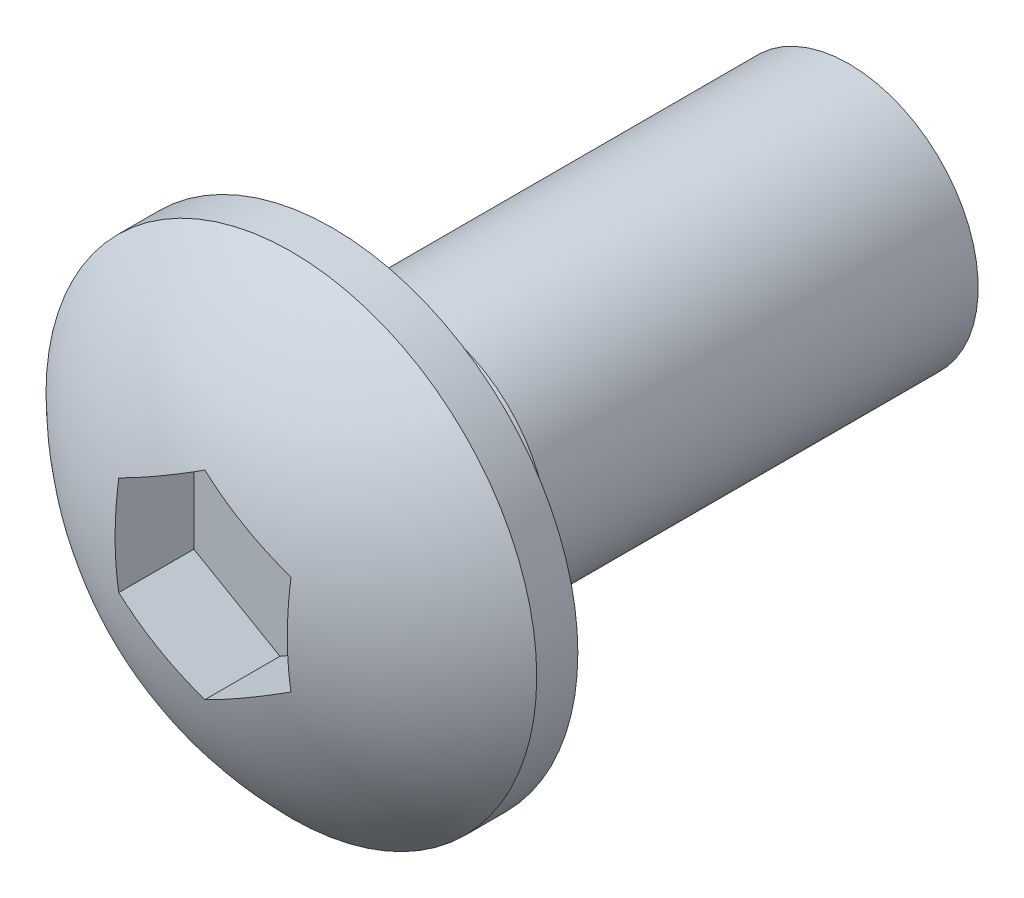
ISO-10303-21;
HEADER;
FILE_DESCRIPTION(('STEP AP214'),'2;1');
FILE_NAME('part.step','',(''),(''),'','','');
FILE_SCHEMA(('AUTOMOTIVE_DESIGN { 1 0 10303 214 1 1 1 1 }'));
ENDSEC;
DATA;
#1=APPLICATION_CONTEXT('core data for automotive mechanical design processes');
#2=APPLICATION_PROTOCOL_DEFINITION('international standard','automotive_design',2000,#1);
#3=PRODUCT_CONTEXT('',#1,'mechanical');
#4=PRODUCT('Part','Part','',(#3));
#5=PRODUCT_RELATED_PRODUCT_CATEGORY('part','',(#4));
#6=PRODUCT_DEFINITION_FORMATION('','',#4);
#7=PRODUCT_DEFINITION_CONTEXT('part definition',#1,'design');
#8=PRODUCT_DEFINITION('design','',#6,#7);
#9=PRODUCT_DEFINITION_SHAPE('','',#8);
#10=(LENGTH_UNIT() NAMED_UNIT(*) SI_UNIT(.MILLI.,.METRE.));
#11=(NAMED_UNIT(*) PLANE_ANGLE_UNIT() SI_UNIT($,.RADIAN.));
#12=(NAMED_UNIT(*) SI_UNIT($,.STERADIAN.) SOLID_ANGLE_UNIT());
#13=UNCERTAINTY_MEASURE_WITH_UNIT(LENGTH_MEASURE(1.E-05),#10,'distance_accuracy_value','');
#14=(GEOMETRIC_REPRESENTATION_CONTEXT(3) GLOBAL_UNCERTAINTY_ASSIGNED_CONTEXT((#13)) GLOBAL_UNIT_ASSIGNED_CONTEXT((#10,
#11,#12)) REPRESENTATION_CONTEXT('',''));
#15=CARTESIAN_POINT('',(0.,0.,0.));
#16=DIRECTION('',(0.,0.,1.));
#17=DIRECTION('',(1.,0.,0.));
#18=AXIS2_PLACEMENT_3D('',#15,#16,#17);
#19=CARTESIAN_POINT('',(0.,2.85,0.));
#20=DIRECTION('',(0.,0.,-1.));
#21=DIRECTION('',(0.,1.,0.));
#22=AXIS2_PLACEMENT_3D('',#19,#20,#21);
#23=PLANE('',#22);
#24=CARTESIAN_POINT('',(0.,0.,0.));
#25=DIRECTION('',(0.,0.,-1.));
#26=DIRECTION('',(0.,1.,0.));
#27=AXIS2_PLACEMENT_3D('',#24,#25,#26);
#28=CIRCLE('',#27,1.45771027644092);
#29=CARTESIAN_POINT('',(0.,1.45771027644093,0.));
#30=VERTEX_POINT('',#29);
#31=EDGE_CURVE('E132',#30,#30,#28,.F.);
#32=ORIENTED_EDGE('',*,*,#31,.T.);
#33=EDGE_LOOP('',(#32));
#34=FACE_BOUND('',#33,.T.);
#35=CARTESIAN_POINT('',(0.,0.,0.));
#36=DIRECTION('',(0.,0.,1.));
#37=DIRECTION('',(0.,-1.,0.));
#38=AXIS2_PLACEMENT_3D('',#35,#36,#37);
#39=CIRCLE('',#38,2.84999999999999);
#40=CARTESIAN_POINT('',(0.,-2.84999999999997,0.));
#41=VERTEX_POINT('',#40);
#42=EDGE_CURVE('E129',#41,#41,#39,.T.);
#43=ORIENTED_EDGE('',*,*,#42,.F.);
#44=EDGE_LOOP('',(#43));
#45=FACE_BOUND('',#44,.T.);
#46=ADVANCED_FACE('F26',(#34,#45),#23,.T.);
#47=CARTESIAN_POINT('',(0.,0.,73.3941268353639));
#48=DIRECTION('',(0.,0.,1.));
#49=DIRECTION('',(0.,-1.,0.));
#50=AXIS2_PLACEMENT_3D('',#47,#48,#49);
#51=CYLINDRICAL_SURFACE('',#50,2.84999999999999);
#52=ORIENTED_EDGE('',*,*,#42,.T.);
#53=EDGE_LOOP('',(#52));
#54=FACE_BOUND('',#53,.T.);
#55=CARTESIAN_POINT('',(0.,0.,0.477498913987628));
#56=DIRECTION('',(0.,0.,1.));
#57=DIRECTION('',(0.,-1.,0.));
#58=AXIS2_PLACEMENT_3D('',#55,#56,#57);
#59=CIRCLE('',#58,2.84999999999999);
#60=CARTESIAN_POINT('',(0.,-2.84999999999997,0.477498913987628));
#61=VERTEX_POINT('',#60);
#62=EDGE_CURVE('E126',#61,#61,#59,.T.);
#63=ORIENTED_EDGE('',*,*,#62,.F.);
#64=EDGE_LOOP('',(#63));
#65=FACE_BOUND('',#64,.T.);
#66=ADVANCED_FACE('F168',(#54,#65),#51,.T.);
#67=CARTESIAN_POINT('',(0.,0.,-2.4));
#68=DIRECTION('',(0.,0.,1.));
#69=DIRECTION('',(0.,1.,0.));
#70=AXIS2_PLACEMENT_3D('',#67,#68,#69);
#71=SPHERICAL_SURFACE('',#70,4.05);
#72=CARTESIAN_POINT('',(0.5,-0.866025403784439,-2.4));
#73=DIRECTION('',(0.5,-0.866025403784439,0.));
#74=DIRECTION('',(0.866025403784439,0.5,0.));
#75=AXIS2_PLACEMENT_3D('',#72,#73,#74);
#76=CIRCLE('',#75,3.92460189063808);
#77=CARTESIAN_POINT('',(1.,-0.577350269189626,1.48190245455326));
#78=VERTEX_POINT('',#77);
#79=CARTESIAN_POINT('',(0.,-1.15470053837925,1.48190245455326));
#80=VERTEX_POINT('',#79);
#81=EDGE_CURVE('E135',#78,#80,#76,.T.);
#82=ORIENTED_EDGE('',*,*,#81,.T.);
#83=CARTESIAN_POINT('',(-0.5,-0.866025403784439,-2.4));
#84=DIRECTION('',(-0.5,-0.866025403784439,0.));
#85=DIRECTION('',(0.866025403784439,-0.5,0.));
#86=AXIS2_PLACEMENT_3D('',#83,#84,#85);
#87=CIRCLE('',#86,3.92460189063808);
#88=CARTESIAN_POINT('',(-1.,-0.577350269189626,1.48190245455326));
#89=VERTEX_POINT('',#88);
#90=EDGE_CURVE('E11',#80,#89,#87,.T.);
#91=ORIENTED_EDGE('',*,*,#90,.T.);
#92=CARTESIAN_POINT('',(-1.,0.,-2.4));
#93=DIRECTION('',(-1.,0.,0.));
#94=DIRECTION('',(0.,0.,1.));
#95=AXIS2_PLACEMENT_3D('',#92,#93,#94);
#96=CIRCLE('',#95,3.92460189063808);
#97=CARTESIAN_POINT('',(-1.,0.577350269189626,1.48190245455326));
#98=VERTEX_POINT('',#97);
#99=EDGE_CURVE('E33',#89,#98,#96,.T.);
#100=ORIENTED_EDGE('',*,*,#99,.T.);
#101=CARTESIAN_POINT('',(-0.5,0.866025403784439,-2.4));
#102=DIRECTION('',(-0.5,0.866025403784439,0.));
#103=DIRECTION('',(-0.866025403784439,-0.5,0.));
#104=AXIS2_PLACEMENT_3D('',#101,#102,#103);
#105=CIRCLE('',#104,3.92460189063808);
#106=CARTESIAN_POINT('',(0.,1.15470053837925,1.48190245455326));
#107=VERTEX_POINT('',#106);
#108=EDGE_CURVE('E143',#98,#107,#105,.T.);
#109=ORIENTED_EDGE('',*,*,#108,.T.);
#110=CARTESIAN_POINT('',(0.5,0.866025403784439,-2.4));
#111=DIRECTION('',(0.5,0.866025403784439,0.));
#112=DIRECTION('',(-0.866025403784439,0.5,0.));
#113=AXIS2_PLACEMENT_3D('',#110,#111,#112);
#114=CIRCLE('',#113,3.92460189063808);
#115=CARTESIAN_POINT('',(1.,0.577350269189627,1.48190245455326));
#116=VERTEX_POINT('',#115);
#117=EDGE_CURVE('E140',#107,#116,#114,.T.);
#118=ORIENTED_EDGE('',*,*,#117,.T.);
#119=CARTESIAN_POINT('',(1.,0.,-2.4));
#120=DIRECTION('',(1.,0.,0.));
#121=DIRECTION('',(0.,1.,0.));
#122=AXIS2_PLACEMENT_3D('',#119,#120,#121);
#123=CIRCLE('',#122,3.92460189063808);
#124=EDGE_CURVE('E137',#116,#78,#123,.T.);
#125=ORIENTED_EDGE('',*,*,#124,.T.);
#126=EDGE_LOOP('',(#82,#91,#100,#109,#118,#125));
#127=FACE_BOUND('',#126,.T.);
#128=ORIENTED_EDGE('',*,*,#62,.T.);
#129=EDGE_LOOP('',(#128));
#130=FACE_BOUND('',#129,.T.);
#131=ADVANCED_FACE('F146',(#127,#130),#71,.T.);
#132=CARTESIAN_POINT('',(0.,1.5,-6.));
#133=DIRECTION('',(0.,0.,-1.));
#134=DIRECTION('',(0.,1.,0.));
#135=AXIS2_PLACEMENT_3D('',#132,#133,#134);
#136=PLANE('',#135);
#137=CARTESIAN_POINT('',(0.,0.,-6.00000000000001));
#138=DIRECTION('',(0.,0.,1.));
#139=DIRECTION('',(0.,-1.,0.));
#140=AXIS2_PLACEMENT_3D('',#137,#138,#139);
#141=CIRCLE('',#140,1.49999999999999);
#142=CARTESIAN_POINT('',(0.,-1.49999999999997,-6.00000000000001));
#143=VERTEX_POINT('',#142);
#144=EDGE_CURVE('E123',#143,#143,#141,.T.);
#145=ORIENTED_EDGE('',*,*,#144,.F.);
#146=EDGE_LOOP('',(#145));
#147=FACE_BOUND('',#146,.T.);
#148=ADVANCED_FACE('F182',(#147),#136,.T.);
#149=CARTESIAN_POINT('',(0.,0.,73.3941268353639));
#150=DIRECTION('',(0.,0.,1.));
#151=DIRECTION('',(0.,-1.,0.));
#152=AXIS2_PLACEMENT_3D('',#149,#150,#151);
#153=CYLINDRICAL_SURFACE('',#152,1.49999999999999);
#154=ORIENTED_EDGE('',*,*,#144,.T.);
#155=EDGE_LOOP('',(#154));
#156=FACE_BOUND('',#155,.T.);
#157=CARTESIAN_POINT('',(0.,0.,-1.));
#158=DIRECTION('',(0.,0.,1.));
#159=DIRECTION('',(0.,-1.,0.));
#160=AXIS2_PLACEMENT_3D('',#157,#158,#159);
#161=CIRCLE('',#160,1.49999999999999);
#162=CARTESIAN_POINT('',(0.,-1.49999999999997,-1.));
#163=VERTEX_POINT('',#162);
#164=EDGE_CURVE('E120',#163,#163,#161,.T.);
#165=ORIENTED_EDGE('',*,*,#164,.F.);
#166=EDGE_LOOP('',(#165));
#167=FACE_BOUND('',#166,.T.);
#168=ADVANCED_FACE('F187',(#156,#167),#153,.T.);
#169=CARTESIAN_POINT('',(0.,0.,-0.157898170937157));
#170=DIRECTION('',(0.,0.,-1.));
#171=DIRECTION('',(0.,1.,0.));
#172=AXIS2_PLACEMENT_3D('',#169,#170,#171);
#173=CONICAL_SURFACE('',#172,1.19349999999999,0.349065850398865);
#174=ORIENTED_EDGE('',*,*,#164,.T.);
#175=EDGE_LOOP('',(#174));
#176=FACE_BOUND('',#175,.T.);
#177=CARTESIAN_POINT('',(0.,0.,-0.157898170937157));
#178=DIRECTION('',(0.,0.,1.));
#179=DIRECTION('',(0.,-1.,0.));
#180=AXIS2_PLACEMENT_3D('',#177,#178,#179);
#181=CIRCLE('',#180,1.19349999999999);
#182=CARTESIAN_POINT('',(0.,-1.19349999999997,-0.157898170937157));
#183=VERTEX_POINT('',#182);
#184=EDGE_CURVE('E108',#183,#183,#181,.T.);
#185=ORIENTED_EDGE('',*,*,#184,.F.);
#186=EDGE_LOOP('',(#185));
#187=FACE_BOUND('',#186,.T.);
#188=ADVANCED_FACE('F193',(#176,#187),#173,.T.);
#189=CARTESIAN_POINT('',(0.,0.,-0.300000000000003));
#190=DIRECTION('',(0.,0.,-1.));
#191=DIRECTION('',(0.,1.,0.));
#192=AXIS2_PLACEMENT_3D('',#189,#190,#191);
#193=TOROIDAL_SURFACE('',#192,1.45771027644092,0.3);
#194=ORIENTED_EDGE('',*,*,#184,.T.);
#195=EDGE_LOOP('',(#194));
#196=FACE_BOUND('',#195,.T.);
#197=ORIENTED_EDGE('',*,*,#31,.F.);
#198=EDGE_LOOP('',(#197));
#199=FACE_BOUND('',#198,.T.);
#200=ADVANCED_FACE('F164',(#196,#199),#193,.F.);
#201=CARTESIAN_POINT('',(-1.,-0.577350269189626,0.609999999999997));
#202=DIRECTION('',(-0.5,-0.866025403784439,0.));
#203=DIRECTION('',(0.866025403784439,-0.5,0.));
#204=AXIS2_PLACEMENT_3D('',#201,#202,#203);
#205=PLANE('',#204);
#206=DIRECTION('',(0.,0.,1.));
#207=VECTOR('',#206,1.);
#208=CARTESIAN_POINT('',(0.,-1.15470053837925,0.609999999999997));
#209=LINE('',#208,#207);
#210=CARTESIAN_POINT('',(0.,-1.15470053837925,0.609999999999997));
#211=VERTEX_POINT('',#210);
#212=EDGE_CURVE('E40',#211,#80,#209,.T.);
#213=ORIENTED_EDGE('',*,*,#212,.F.);
#214=DIRECTION('',(0.866025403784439,-0.5,0.));
#215=VECTOR('',#214,1.);
#216=CARTESIAN_POINT('',(-1.,-0.577350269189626,0.609999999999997));
#217=LINE('',#216,#215);
#218=CARTESIAN_POINT('',(-1.,-0.577350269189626,0.609999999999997));
#219=VERTEX_POINT('',#218);
#220=EDGE_CURVE('E79',#219,#211,#217,.T.);
#221=ORIENTED_EDGE('',*,*,#220,.F.);
#222=DIRECTION('',(0.,0.,1.));
#223=VECTOR('',#222,1.);
#224=CARTESIAN_POINT('',(-1.,-0.577350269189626,0.609999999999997));
#225=LINE('',#224,#223);
#226=EDGE_CURVE('E106',#219,#89,#225,.T.);
#227=ORIENTED_EDGE('',*,*,#226,.T.);
#228=ORIENTED_EDGE('',*,*,#90,.F.);
#229=EDGE_LOOP('',(#213,#221,#227,#228));
#230=FACE_BOUND('',#229,.T.);
#231=ADVANCED_FACE('F77',(#230),#205,.F.);
#232=CARTESIAN_POINT('',(-1.,0.577350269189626,0.609999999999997));
#233=DIRECTION('',(-1.,0.,0.));
#234=DIRECTION('',(0.,0.,1.));
#235=AXIS2_PLACEMENT_3D('',#232,#233,#234);
#236=PLANE('',#235);
#237=ORIENTED_EDGE('',*,*,#226,.F.);
#238=DIRECTION('',(0.,-1.,0.));
#239=VECTOR('',#238,1.);
#240=CARTESIAN_POINT('',(-1.,0.577350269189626,0.609999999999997));
#241=LINE('',#240,#239);
#242=CARTESIAN_POINT('',(-1.,0.577350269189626,0.609999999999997));
#243=VERTEX_POINT('',#242);
#244=EDGE_CURVE('E83',#243,#219,#241,.T.);
#245=ORIENTED_EDGE('',*,*,#244,.F.);
#246=DIRECTION('',(0.,0.,1.));
#247=VECTOR('',#246,1.);
#248=CARTESIAN_POINT('',(-1.,0.577350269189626,0.609999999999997));
#249=LINE('',#248,#247);
#250=EDGE_CURVE('E109',#243,#98,#249,.T.);
#251=ORIENTED_EDGE('',*,*,#250,.T.);
#252=ORIENTED_EDGE('',*,*,#99,.F.);
#253=EDGE_LOOP('',(#237,#245,#251,#252));
#254=FACE_BOUND('',#253,.T.);
#255=ADVANCED_FACE('F156',(#254),#236,.F.);
#256=CARTESIAN_POINT('',(0.,1.15470053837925,0.609999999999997));
#257=DIRECTION('',(-0.5,0.866025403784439,0.));
#258=DIRECTION('',(-0.866025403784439,-0.5,0.));
#259=AXIS2_PLACEMENT_3D('',#256,#257,#258);
#260=PLANE('',#259);
#261=ORIENTED_EDGE('',*,*,#250,.F.);
#262=DIRECTION('',(-0.866025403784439,-0.5,0.));
#263=VECTOR('',#262,1.);
#264=CARTESIAN_POINT('',(0.,1.15470053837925,0.609999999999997));
#265=LINE('',#264,#263);
#266=CARTESIAN_POINT('',(0.,1.15470053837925,0.609999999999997));
#267=VERTEX_POINT('',#266);
#268=EDGE_CURVE('E103',#267,#243,#265,.T.);
#269=ORIENTED_EDGE('',*,*,#268,.F.);
#270=DIRECTION('',(0.,0.,1.));
#271=VECTOR('',#270,1.);
#272=CARTESIAN_POINT('',(0.,1.15470053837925,0.609999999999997));
#273=LINE('',#272,#271);
#274=EDGE_CURVE('E111',#267,#107,#273,.T.);
#275=ORIENTED_EDGE('',*,*,#274,.T.);
#276=ORIENTED_EDGE('',*,*,#108,.F.);
#277=EDGE_LOOP('',(#261,#269,#275,#276));
#278=FACE_BOUND('',#277,.T.);
#279=ADVANCED_FACE('F155',(#278),#260,.F.);
#280=CARTESIAN_POINT('',(1.,0.577350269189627,0.609999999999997));
#281=DIRECTION('',(0.5,0.866025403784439,0.));
#282=DIRECTION('',(-0.866025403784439,0.5,0.));
#283=AXIS2_PLACEMENT_3D('',#280,#281,#282);
#284=PLANE('',#283);
#285=ORIENTED_EDGE('',*,*,#274,.F.);
#286=DIRECTION('',(-0.866025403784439,0.5,0.));
#287=VECTOR('',#286,1.);
#288=CARTESIAN_POINT('',(1.,0.577350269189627,0.609999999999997));
#289=LINE('',#288,#287);
#290=CARTESIAN_POINT('',(1.,0.577350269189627,0.609999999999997));
#291=VERTEX_POINT('',#290);
#292=EDGE_CURVE('E100',#291,#267,#289,.T.);
#293=ORIENTED_EDGE('',*,*,#292,.F.);
#294=DIRECTION('',(0.,0.,1.));
#295=VECTOR('',#294,1.);
#296=CARTESIAN_POINT('',(1.,0.577350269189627,0.609999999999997));
#297=LINE('',#296,#295);
#298=EDGE_CURVE('E114',#291,#116,#297,.T.);
#299=ORIENTED_EDGE('',*,*,#298,.T.);
#300=ORIENTED_EDGE('',*,*,#117,.F.);
#301=EDGE_LOOP('',(#285,#293,#299,#300));
#302=FACE_BOUND('',#301,.T.);
#303=ADVANCED_FACE('F153',(#302),#284,.F.);
#304=CARTESIAN_POINT('',(1.,-0.577350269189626,0.609999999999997));
#305=DIRECTION('',(1.,0.,0.));
#306=DIRECTION('',(0.,1.,0.));
#307=AXIS2_PLACEMENT_3D('',#304,#305,#306);
#308=PLANE('',#307);
#309=ORIENTED_EDGE('',*,*,#298,.F.);
#310=DIRECTION('',(0.,1.,0.));
#311=VECTOR('',#310,1.);
#312=CARTESIAN_POINT('',(1.,-0.577350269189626,0.609999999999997));
#313=LINE('',#312,#311);
#314=CARTESIAN_POINT('',(1.,-0.577350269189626,0.609999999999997));
#315=VERTEX_POINT('',#314);
#316=EDGE_CURVE('E92',#315,#291,#313,.T.);
#317=ORIENTED_EDGE('',*,*,#316,.F.);
#318=DIRECTION('',(0.,0.,1.));
#319=VECTOR('',#318,1.);
#320=CARTESIAN_POINT('',(1.,-0.577350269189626,0.609999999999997));
#321=LINE('',#320,#319);
#322=EDGE_CURVE('E82',#315,#78,#321,.T.);
#323=ORIENTED_EDGE('',*,*,#322,.T.);
#324=ORIENTED_EDGE('',*,*,#124,.F.);
#325=EDGE_LOOP('',(#309,#317,#323,#324));
#326=FACE_BOUND('',#325,.T.);
#327=ADVANCED_FACE('F149',(#326),#308,.F.);
#328=CARTESIAN_POINT('',(0.,-1.15470053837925,0.609999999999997));
#329=DIRECTION('',(0.5,-0.866025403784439,0.));
#330=DIRECTION('',(0.866025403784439,0.5,0.));
#331=AXIS2_PLACEMENT_3D('',#328,#329,#330);
#332=PLANE('',#331);
#333=ORIENTED_EDGE('',*,*,#322,.F.);
#334=DIRECTION('',(0.866025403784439,0.5,0.));
#335=VECTOR('',#334,1.);
#336=CARTESIAN_POINT('',(0.,-1.15470053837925,0.609999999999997));
#337=LINE('',#336,#335);
#338=EDGE_CURVE('E86',#211,#315,#337,.T.);
#339=ORIENTED_EDGE('',*,*,#338,.F.);
#340=ORIENTED_EDGE('',*,*,#212,.T.);
#341=ORIENTED_EDGE('',*,*,#81,.F.);
#342=EDGE_LOOP('',(#333,#339,#340,#341));
#343=FACE_BOUND('',#342,.T.);
#344=ADVANCED_FACE('F87',(#343),#332,.F.);
#345=CARTESIAN_POINT('',(0.,-1.15470053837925,0.609999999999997));
#346=DIRECTION('',(0.,0.,1.));
#347=DIRECTION('',(1.,0.,0.));
#348=AXIS2_PLACEMENT_3D('',#345,#346,#347);
#349=PLANE('',#348);
#350=ORIENTED_EDGE('',*,*,#220,.T.);
#351=ORIENTED_EDGE('',*,*,#338,.T.);
#352=ORIENTED_EDGE('',*,*,#316,.T.);
#353=ORIENTED_EDGE('',*,*,#292,.T.);
#354=ORIENTED_EDGE('',*,*,#268,.T.);
#355=ORIENTED_EDGE('',*,*,#244,.T.);
#356=EDGE_LOOP('',(#350,#351,#352,#353,#354,#355));
#357=FACE_BOUND('',#356,.T.);
#358=ADVANCED_FACE('F94',(#357),#349,.T.);
#359=CLOSED_SHELL('',(#46,#66,#131,#148,#168,#188,#200,#231,#255,#279,#303,#327,#344,#358));
#360=MANIFOLD_SOLID_BREP('B2',#359);
#361=ADVANCED_BREP_SHAPE_REPRESENTATION('',(#18,#360),#14);
#362=SHAPE_DEFINITION_REPRESENTATION(#9,#361);
ENDSEC;
END-ISO-10303-21;
